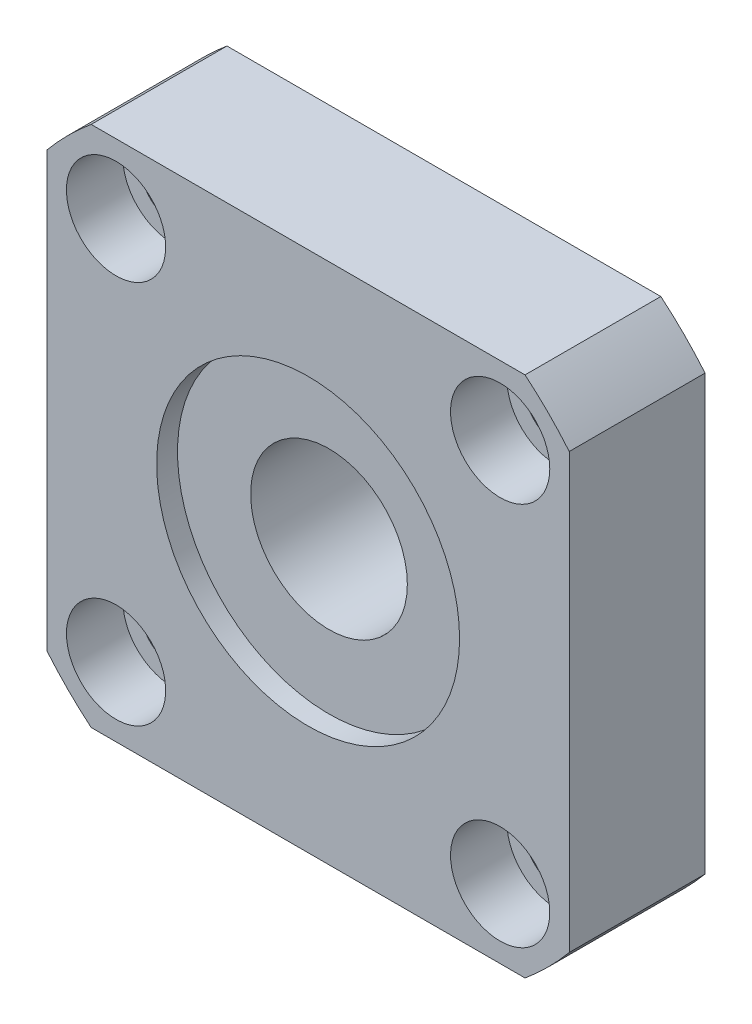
ISO-10303-21;
HEADER;
FILE_DESCRIPTION(('STEP AP214'),'2;1');
FILE_NAME('part.step','',(''),(''),'','','');
FILE_SCHEMA(('AUTOMOTIVE_DESIGN { 1 0 10303 214 1 1 1 1 }'));
ENDSEC;
DATA;
#1=APPLICATION_CONTEXT('core data for automotive mechanical design processes');
#2=APPLICATION_PROTOCOL_DEFINITION('international standard','automotive_design',2000,#1);
#3=PRODUCT_CONTEXT('',#1,'mechanical');
#4=PRODUCT('Part','Part','',(#3));
#5=PRODUCT_RELATED_PRODUCT_CATEGORY('part','',(#4));
#6=PRODUCT_DEFINITION_FORMATION('','',#4);
#7=PRODUCT_DEFINITION_CONTEXT('part definition',#1,'design');
#8=PRODUCT_DEFINITION('design','',#6,#7);
#9=PRODUCT_DEFINITION_SHAPE('','',#8);
#10=(LENGTH_UNIT() NAMED_UNIT(*) SI_UNIT(.MILLI.,.METRE.));
#11=(NAMED_UNIT(*) PLANE_ANGLE_UNIT() SI_UNIT($,.RADIAN.));
#12=(NAMED_UNIT(*) SI_UNIT($,.STERADIAN.) SOLID_ANGLE_UNIT());
#13=UNCERTAINTY_MEASURE_WITH_UNIT(LENGTH_MEASURE(1.E-05),#10,'distance_accuracy_value','');
#14=(GEOMETRIC_REPRESENTATION_CONTEXT(3) GLOBAL_UNCERTAINTY_ASSIGNED_CONTEXT((#13)) GLOBAL_UNIT_ASSIGNED_CONTEXT((#10,
#11,#12)) REPRESENTATION_CONTEXT('',''));
#15=CARTESIAN_POINT('',(0.,0.,0.));
#16=DIRECTION('',(0.,0.,1.));
#17=DIRECTION('',(1.,0.,0.));
#18=AXIS2_PLACEMENT_3D('',#15,#16,#17);
#19=CARTESIAN_POINT('',(0.,0.,13.));
#20=DIRECTION('',(0.,0.,-1.));
#21=DIRECTION('',(-1.,0.,0.));
#22=AXIS2_PLACEMENT_3D('',#19,#20,#21);
#23=CYLINDRICAL_SURFACE('',#22,7.5);
#24=CARTESIAN_POINT('',(0.,0.,0.));
#25=DIRECTION('',(0.,0.,1.));
#26=DIRECTION('',(1.,0.,0.));
#27=AXIS2_PLACEMENT_3D('',#24,#25,#26);
#28=CIRCLE('',#27,7.5);
#29=CARTESIAN_POINT('',(7.5,0.,0.));
#30=VERTEX_POINT('',#29);
#31=EDGE_CURVE('E95',#30,#30,#28,.T.);
#32=ORIENTED_EDGE('',*,*,#31,.F.);
#33=EDGE_LOOP('',(#32));
#34=FACE_BOUND('',#33,.T.);
#35=CARTESIAN_POINT('',(0.,0.,11.));
#36=DIRECTION('',(0.,0.,1.));
#37=DIRECTION('',(1.,0.,0.));
#38=AXIS2_PLACEMENT_3D('',#35,#36,#37);
#39=CIRCLE('',#38,7.5);
#40=CARTESIAN_POINT('',(7.5,0.,11.));
#41=VERTEX_POINT('',#40);
#42=EDGE_CURVE('E18',#41,#41,#39,.T.);
#43=ORIENTED_EDGE('',*,*,#42,.T.);
#44=EDGE_LOOP('',(#43));
#45=FACE_BOUND('',#44,.T.);
#46=ADVANCED_FACE('F14',(#34,#45),#23,.F.);
#47=CARTESIAN_POINT('',(-18.3847763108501,18.3847763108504,0.));
#48=DIRECTION('',(0.,0.,1.));
#49=DIRECTION('',(1.,0.,0.));
#50=AXIS2_PLACEMENT_3D('',#47,#48,#49);
#51=CYLINDRICAL_SURFACE('',#50,3.);
#52=CARTESIAN_POINT('',(-18.3847763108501,18.3847763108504,0.));
#53=DIRECTION('',(0.,0.,1.));
#54=DIRECTION('',(0.,1.,0.));
#55=AXIS2_PLACEMENT_3D('',#52,#53,#54);
#56=CIRCLE('',#55,3.);
#57=CARTESIAN_POINT('',(-18.3847763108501,21.3847763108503,0.));
#58=VERTEX_POINT('',#57);
#59=EDGE_CURVE('E158',#58,#58,#56,.T.);
#60=ORIENTED_EDGE('',*,*,#59,.F.);
#61=EDGE_LOOP('',(#60));
#62=FACE_BOUND('',#61,.T.);
#63=CARTESIAN_POINT('',(-18.3847763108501,18.3847763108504,7.6));
#64=DIRECTION('',(0.,0.,1.));
#65=DIRECTION('',(1.,0.,0.));
#66=AXIS2_PLACEMENT_3D('',#63,#64,#65);
#67=CIRCLE('',#66,3.);
#68=CARTESIAN_POINT('',(-15.3847763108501,18.3847763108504,7.6));
#69=VERTEX_POINT('',#68);
#70=EDGE_CURVE('E164',#69,#69,#67,.F.);
#71=ORIENTED_EDGE('',*,*,#70,.F.);
#72=EDGE_LOOP('',(#71));
#73=FACE_BOUND('',#72,.T.);
#74=ADVANCED_FACE('F206',(#62,#73),#51,.F.);
#75=CARTESIAN_POINT('',(-18.3847763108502,-18.3847763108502,0.));
#76=DIRECTION('',(0.,0.,1.));
#77=DIRECTION('',(1.,0.,0.));
#78=AXIS2_PLACEMENT_3D('',#75,#76,#77);
#79=CYLINDRICAL_SURFACE('',#78,3.);
#80=CARTESIAN_POINT('',(-18.3847763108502,-18.3847763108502,0.));
#81=DIRECTION('',(0.,0.,1.));
#82=DIRECTION('',(-1.,0.,0.));
#83=AXIS2_PLACEMENT_3D('',#80,#81,#82);
#84=CIRCLE('',#83,3.);
#85=CARTESIAN_POINT('',(-21.3847763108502,-18.3847763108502,0.));
#86=VERTEX_POINT('',#85);
#87=EDGE_CURVE('E189',#86,#86,#84,.T.);
#88=ORIENTED_EDGE('',*,*,#87,.F.);
#89=EDGE_LOOP('',(#88));
#90=FACE_BOUND('',#89,.T.);
#91=CARTESIAN_POINT('',(-18.3847763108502,-18.3847763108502,7.6));
#92=DIRECTION('',(0.,0.,1.));
#93=DIRECTION('',(1.,0.,0.));
#94=AXIS2_PLACEMENT_3D('',#91,#92,#93);
#95=CIRCLE('',#94,3.);
#96=CARTESIAN_POINT('',(-15.3847763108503,-18.3847763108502,7.6));
#97=VERTEX_POINT('',#96);
#98=EDGE_CURVE('E160',#97,#97,#95,.F.);
#99=ORIENTED_EDGE('',*,*,#98,.F.);
#100=EDGE_LOOP('',(#99));
#101=FACE_BOUND('',#100,.T.);
#102=ADVANCED_FACE('F288',(#90,#101),#79,.F.);
#103=CARTESIAN_POINT('',(18.3847763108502,-18.3847763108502,0.));
#104=DIRECTION('',(0.,0.,1.));
#105=DIRECTION('',(1.,0.,0.));
#106=AXIS2_PLACEMENT_3D('',#103,#104,#105);
#107=CYLINDRICAL_SURFACE('',#106,3.);
#108=CARTESIAN_POINT('',(18.3847763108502,-18.3847763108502,0.));
#109=DIRECTION('',(0.,0.,1.));
#110=DIRECTION('',(0.,-1.,0.));
#111=AXIS2_PLACEMENT_3D('',#108,#109,#110);
#112=CIRCLE('',#111,3.);
#113=CARTESIAN_POINT('',(18.3847763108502,-21.3847763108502,0.));
#114=VERTEX_POINT('',#113);
#115=EDGE_CURVE('E192',#114,#114,#112,.T.);
#116=ORIENTED_EDGE('',*,*,#115,.F.);
#117=EDGE_LOOP('',(#116));
#118=FACE_BOUND('',#117,.T.);
#119=CARTESIAN_POINT('',(18.3847763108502,-18.3847763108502,7.6));
#120=DIRECTION('',(0.,0.,1.));
#121=DIRECTION('',(1.,0.,0.));
#122=AXIS2_PLACEMENT_3D('',#119,#120,#121);
#123=CIRCLE('',#122,3.);
#124=CARTESIAN_POINT('',(21.3847763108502,-18.3847763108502,7.6));
#125=VERTEX_POINT('',#124);
#126=EDGE_CURVE('E155',#125,#125,#123,.F.);
#127=ORIENTED_EDGE('',*,*,#126,.F.);
#128=EDGE_LOOP('',(#127));
#129=FACE_BOUND('',#128,.T.);
#130=ADVANCED_FACE('F276',(#118,#129),#107,.F.);
#131=CARTESIAN_POINT('',(18.3847763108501,18.3847763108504,0.));
#132=DIRECTION('',(0.,0.,1.));
#133=DIRECTION('',(1.,0.,0.));
#134=AXIS2_PLACEMENT_3D('',#131,#132,#133);
#135=CYLINDRICAL_SURFACE('',#134,3.);
#136=CARTESIAN_POINT('',(18.3847763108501,18.3847763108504,0.));
#137=DIRECTION('',(0.,0.,1.));
#138=DIRECTION('',(1.,0.,0.));
#139=AXIS2_PLACEMENT_3D('',#136,#137,#138);
#140=CIRCLE('',#139,3.);
#141=CARTESIAN_POINT('',(21.3847763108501,18.3847763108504,0.));
#142=VERTEX_POINT('',#141);
#143=EDGE_CURVE('E153',#142,#142,#140,.T.);
#144=ORIENTED_EDGE('',*,*,#143,.F.);
#145=EDGE_LOOP('',(#144));
#146=FACE_BOUND('',#145,.T.);
#147=CARTESIAN_POINT('',(18.3847763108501,18.3847763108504,7.6));
#148=DIRECTION('',(0.,0.,1.));
#149=DIRECTION('',(1.,0.,0.));
#150=AXIS2_PLACEMENT_3D('',#147,#148,#149);
#151=CIRCLE('',#150,3.);
#152=CARTESIAN_POINT('',(21.3847763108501,18.3847763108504,7.6));
#153=VERTEX_POINT('',#152);
#154=EDGE_CURVE('E150',#153,#153,#151,.F.);
#155=ORIENTED_EDGE('',*,*,#154,.F.);
#156=EDGE_LOOP('',(#155));
#157=FACE_BOUND('',#156,.T.);
#158=ADVANCED_FACE('F225',(#146,#157),#135,.F.);
#159=CARTESIAN_POINT('',(0.,0.,13.));
#160=DIRECTION('',(0.,0.,1.));
#161=DIRECTION('',(1.,0.,0.));
#162=AXIS2_PLACEMENT_3D('',#159,#160,#161);
#163=PLANE('',#162);
#164=CARTESIAN_POINT('',(0.,0.,13.));
#165=DIRECTION('',(0.,0.,1.));
#166=DIRECTION('',(1.,0.,0.));
#167=AXIS2_PLACEMENT_3D('',#164,#165,#166);
#168=CIRCLE('',#167,14.5);
#169=CARTESIAN_POINT('',(14.5,0.,13.));
#170=VERTEX_POINT('',#169);
#171=EDGE_CURVE('E213',#170,#170,#168,.T.);
#172=ORIENTED_EDGE('',*,*,#171,.F.);
#173=EDGE_LOOP('',(#172));
#174=FACE_BOUND('',#173,.T.);
#175=CARTESIAN_POINT('',(-18.3847763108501,18.3847763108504,13.));
#176=DIRECTION('',(0.,0.,1.));
#177=DIRECTION('',(0.,1.,0.));
#178=AXIS2_PLACEMENT_3D('',#175,#176,#177);
#179=CIRCLE('',#178,4.75);
#180=CARTESIAN_POINT('',(-18.3847763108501,23.1347763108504,13.));
#181=VERTEX_POINT('',#180);
#182=EDGE_CURVE('E173',#181,#181,#179,.T.);
#183=ORIENTED_EDGE('',*,*,#182,.F.);
#184=EDGE_LOOP('',(#183));
#185=FACE_BOUND('',#184,.T.);
#186=CARTESIAN_POINT('',(-18.3847763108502,-18.3847763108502,13.));
#187=DIRECTION('',(0.,0.,1.));
#188=DIRECTION('',(-1.,0.,0.));
#189=AXIS2_PLACEMENT_3D('',#186,#187,#188);
#190=CIRCLE('',#189,4.75);
#191=CARTESIAN_POINT('',(-23.1347763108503,-18.3847763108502,13.));
#192=VERTEX_POINT('',#191);
#193=EDGE_CURVE('E166',#192,#192,#190,.T.);
#194=ORIENTED_EDGE('',*,*,#193,.F.);
#195=EDGE_LOOP('',(#194));
#196=FACE_BOUND('',#195,.T.);
#197=CARTESIAN_POINT('',(18.3847763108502,-18.3847763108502,13.));
#198=DIRECTION('',(0.,0.,1.));
#199=DIRECTION('',(0.,-1.,0.));
#200=AXIS2_PLACEMENT_3D('',#197,#198,#199);
#201=CIRCLE('',#200,4.75);
#202=CARTESIAN_POINT('',(18.3847763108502,-23.1347763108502,13.));
#203=VERTEX_POINT('',#202);
#204=EDGE_CURVE('E162',#203,#203,#201,.T.);
#205=ORIENTED_EDGE('',*,*,#204,.F.);
#206=EDGE_LOOP('',(#205));
#207=FACE_BOUND('',#206,.T.);
#208=CARTESIAN_POINT('',(18.3847763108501,18.3847763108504,13.));
#209=DIRECTION('',(0.,0.,1.));
#210=DIRECTION('',(1.,0.,0.));
#211=AXIS2_PLACEMENT_3D('',#208,#209,#210);
#212=CIRCLE('',#211,4.75);
#213=CARTESIAN_POINT('',(23.1347763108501,18.3847763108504,13.));
#214=VERTEX_POINT('',#213);
#215=EDGE_CURVE('E195',#214,#214,#212,.T.);
#216=ORIENTED_EDGE('',*,*,#215,.F.);
#217=EDGE_LOOP('',(#216));
#218=FACE_BOUND('',#217,.T.);
#219=CARTESIAN_POINT('',(0.,0.,13.));
#220=DIRECTION('',(0.,0.,1.));
#221=DIRECTION('',(1.,0.,0.));
#222=AXIS2_PLACEMENT_3D('',#219,#220,#221);
#223=CIRCLE('',#222,32.5);
#224=CARTESIAN_POINT('',(25.,20.7665596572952,13.));
#225=VERTEX_POINT('',#224);
#226=CARTESIAN_POINT('',(20.7665596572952,25.,13.));
#227=VERTEX_POINT('',#226);
#228=EDGE_CURVE('E120',#225,#227,#223,.T.);
#229=ORIENTED_EDGE('',*,*,#228,.T.);
#230=DIRECTION('',(-1.,0.,0.));
#231=VECTOR('',#230,1.);
#232=CARTESIAN_POINT('',(20.7665596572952,25.,13.));
#233=LINE('',#232,#231);
#234=CARTESIAN_POINT('',(-20.7665596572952,25.,13.));
#235=VERTEX_POINT('',#234);
#236=EDGE_CURVE('E87',#227,#235,#233,.T.);
#237=ORIENTED_EDGE('',*,*,#236,.T.);
#238=CARTESIAN_POINT('',(0.,0.,13.));
#239=DIRECTION('',(0.,0.,-1.));
#240=DIRECTION('',(-1.,0.,0.));
#241=AXIS2_PLACEMENT_3D('',#238,#239,#240);
#242=CIRCLE('',#241,32.5);
#243=CARTESIAN_POINT('',(-25.,20.7665596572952,13.));
#244=VERTEX_POINT('',#243);
#245=EDGE_CURVE('E123',#244,#235,#242,.T.);
#246=ORIENTED_EDGE('',*,*,#245,.F.);
#247=DIRECTION('',(0.,-1.,0.));
#248=VECTOR('',#247,1.);
#249=CARTESIAN_POINT('',(-25.,20.7665596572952,13.));
#250=LINE('',#249,#248);
#251=CARTESIAN_POINT('',(-25.,-20.7665596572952,13.));
#252=VERTEX_POINT('',#251);
#253=EDGE_CURVE('E126',#244,#252,#250,.T.);
#254=ORIENTED_EDGE('',*,*,#253,.T.);
#255=CARTESIAN_POINT('',(0.,0.,13.));
#256=DIRECTION('',(0.,0.,1.));
#257=DIRECTION('',(1.,0.,0.));
#258=AXIS2_PLACEMENT_3D('',#255,#256,#257);
#259=CIRCLE('',#258,32.5);
#260=CARTESIAN_POINT('',(-20.7665596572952,-25.,13.));
#261=VERTEX_POINT('',#260);
#262=EDGE_CURVE('E129',#252,#261,#259,.T.);
#263=ORIENTED_EDGE('',*,*,#262,.T.);
#264=DIRECTION('',(-1.,0.,0.));
#265=VECTOR('',#264,1.);
#266=CARTESIAN_POINT('',(20.7665596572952,-25.,13.));
#267=LINE('',#266,#265);
#268=CARTESIAN_POINT('',(20.7665596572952,-25.,13.));
#269=VERTEX_POINT('',#268);
#270=EDGE_CURVE('E132',#269,#261,#267,.T.);
#271=ORIENTED_EDGE('',*,*,#270,.F.);
#272=CARTESIAN_POINT('',(0.,0.,13.));
#273=DIRECTION('',(0.,0.,-1.));
#274=DIRECTION('',(-1.,0.,0.));
#275=AXIS2_PLACEMENT_3D('',#272,#273,#274);
#276=CIRCLE('',#275,32.5);
#277=CARTESIAN_POINT('',(25.,-20.7665596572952,13.));
#278=VERTEX_POINT('',#277);
#279=EDGE_CURVE('E135',#278,#269,#276,.T.);
#280=ORIENTED_EDGE('',*,*,#279,.F.);
#281=DIRECTION('',(0.,-1.,0.));
#282=VECTOR('',#281,1.);
#283=CARTESIAN_POINT('',(25.,20.7665596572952,13.));
#284=LINE('',#283,#282);
#285=EDGE_CURVE('E137',#225,#278,#284,.T.);
#286=ORIENTED_EDGE('',*,*,#285,.F.);
#287=EDGE_LOOP('',(#229,#237,#246,#254,#263,#271,#280,#286));
#288=FACE_BOUND('',#287,.T.);
#289=ADVANCED_FACE('F222',(#174,#185,#196,#207,#218,#288),#163,.T.);
#290=CARTESIAN_POINT('',(0.,0.,0.));
#291=DIRECTION('',(0.,0.,1.));
#292=DIRECTION('',(1.,0.,0.));
#293=AXIS2_PLACEMENT_3D('',#290,#291,#292);
#294=PLANE('',#293);
#295=ORIENTED_EDGE('',*,*,#59,.T.);
#296=EDGE_LOOP('',(#295));
#297=FACE_BOUND('',#296,.T.);
#298=ORIENTED_EDGE('',*,*,#87,.T.);
#299=EDGE_LOOP('',(#298));
#300=FACE_BOUND('',#299,.T.);
#301=ORIENTED_EDGE('',*,*,#115,.T.);
#302=EDGE_LOOP('',(#301));
#303=FACE_BOUND('',#302,.T.);
#304=ORIENTED_EDGE('',*,*,#143,.T.);
#305=EDGE_LOOP('',(#304));
#306=FACE_BOUND('',#305,.T.);
#307=CARTESIAN_POINT('',(0.,0.,0.));
#308=DIRECTION('',(0.,0.,1.));
#309=DIRECTION('',(1.,0.,0.));
#310=AXIS2_PLACEMENT_3D('',#307,#308,#309);
#311=CIRCLE('',#310,32.5);
#312=CARTESIAN_POINT('',(25.,20.7665596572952,0.));
#313=VERTEX_POINT('',#312);
#314=CARTESIAN_POINT('',(20.7665596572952,25.,0.));
#315=VERTEX_POINT('',#314);
#316=EDGE_CURVE('E91',#313,#315,#311,.T.);
#317=ORIENTED_EDGE('',*,*,#316,.F.);
#318=DIRECTION('',(0.,-1.,0.));
#319=VECTOR('',#318,1.);
#320=CARTESIAN_POINT('',(25.,20.7665596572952,0.));
#321=LINE('',#320,#319);
#322=CARTESIAN_POINT('',(25.,-20.7665596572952,0.));
#323=VERTEX_POINT('',#322);
#324=EDGE_CURVE('E118',#313,#323,#321,.T.);
#325=ORIENTED_EDGE('',*,*,#324,.T.);
#326=CARTESIAN_POINT('',(0.,0.,0.));
#327=DIRECTION('',(0.,0.,-1.));
#328=DIRECTION('',(-1.,0.,0.));
#329=AXIS2_PLACEMENT_3D('',#326,#327,#328);
#330=CIRCLE('',#329,32.5);
#331=CARTESIAN_POINT('',(20.7665596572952,-25.,0.));
#332=VERTEX_POINT('',#331);
#333=EDGE_CURVE('E115',#323,#332,#330,.T.);
#334=ORIENTED_EDGE('',*,*,#333,.T.);
#335=DIRECTION('',(-1.,0.,0.));
#336=VECTOR('',#335,1.);
#337=CARTESIAN_POINT('',(20.7665596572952,-25.,0.));
#338=LINE('',#337,#336);
#339=CARTESIAN_POINT('',(-20.7665596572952,-25.,0.));
#340=VERTEX_POINT('',#339);
#341=EDGE_CURVE('E112',#332,#340,#338,.T.);
#342=ORIENTED_EDGE('',*,*,#341,.T.);
#343=CARTESIAN_POINT('',(0.,0.,0.));
#344=DIRECTION('',(0.,0.,1.));
#345=DIRECTION('',(1.,0.,0.));
#346=AXIS2_PLACEMENT_3D('',#343,#344,#345);
#347=CIRCLE('',#346,32.5);
#348=CARTESIAN_POINT('',(-25.,-20.7665596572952,0.));
#349=VERTEX_POINT('',#348);
#350=EDGE_CURVE('E109',#349,#340,#347,.T.);
#351=ORIENTED_EDGE('',*,*,#350,.F.);
#352=DIRECTION('',(0.,-1.,0.));
#353=VECTOR('',#352,1.);
#354=CARTESIAN_POINT('',(-25.,20.7665596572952,0.));
#355=LINE('',#354,#353);
#356=CARTESIAN_POINT('',(-25.,20.7665596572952,0.));
#357=VERTEX_POINT('',#356);
#358=EDGE_CURVE('E103',#357,#349,#355,.T.);
#359=ORIENTED_EDGE('',*,*,#358,.F.);
#360=CARTESIAN_POINT('',(0.,0.,0.));
#361=DIRECTION('',(0.,0.,-1.));
#362=DIRECTION('',(-1.,0.,0.));
#363=AXIS2_PLACEMENT_3D('',#360,#361,#362);
#364=CIRCLE('',#363,32.5);
#365=CARTESIAN_POINT('',(-20.7665596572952,25.,0.));
#366=VERTEX_POINT('',#365);
#367=EDGE_CURVE('E101',#357,#366,#364,.T.);
#368=ORIENTED_EDGE('',*,*,#367,.T.);
#369=DIRECTION('',(-1.,0.,0.));
#370=VECTOR('',#369,1.);
#371=CARTESIAN_POINT('',(20.7665596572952,25.,0.));
#372=LINE('',#371,#370);
#373=EDGE_CURVE('E84',#315,#366,#372,.T.);
#374=ORIENTED_EDGE('',*,*,#373,.F.);
#375=EDGE_LOOP('',(#317,#325,#334,#342,#351,#359,#368,#374));
#376=FACE_BOUND('',#375,.T.);
#377=ORIENTED_EDGE('',*,*,#31,.T.);
#378=EDGE_LOOP('',(#377));
#379=FACE_BOUND('',#378,.T.);
#380=ADVANCED_FACE('F97',(#297,#300,#303,#306,#376,#379),#294,.F.);
#381=CARTESIAN_POINT('',(0.,0.,13.));
#382=DIRECTION('',(0.,0.,-1.));
#383=DIRECTION('',(-1.,0.,0.));
#384=AXIS2_PLACEMENT_3D('',#381,#382,#383);
#385=CYLINDRICAL_SURFACE('',#384,32.5);
#386=DIRECTION('',(0.,0.,-1.));
#387=VECTOR('',#386,1.);
#388=CARTESIAN_POINT('',(20.7665596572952,25.,13.));
#389=LINE('',#388,#387);
#390=EDGE_CURVE('E9',#227,#315,#389,.T.);
#391=ORIENTED_EDGE('',*,*,#390,.F.);
#392=ORIENTED_EDGE('',*,*,#228,.F.);
#393=DIRECTION('',(0.,0.,-1.));
#394=VECTOR('',#393,1.);
#395=CARTESIAN_POINT('',(25.,20.7665596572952,13.));
#396=LINE('',#395,#394);
#397=EDGE_CURVE('E31',#225,#313,#396,.T.);
#398=ORIENTED_EDGE('',*,*,#397,.T.);
#399=ORIENTED_EDGE('',*,*,#316,.T.);
#400=EDGE_LOOP('',(#391,#392,#398,#399));
#401=FACE_BOUND('',#400,.T.);
#402=ADVANCED_FACE('F92',(#401),#385,.T.);
#403=CARTESIAN_POINT('',(20.7665596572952,25.,13.));
#404=DIRECTION('',(0.,-1.,0.));
#405=DIRECTION('',(0.,0.,-1.));
#406=AXIS2_PLACEMENT_3D('',#403,#404,#405);
#407=PLANE('',#406);
#408=DIRECTION('',(0.,0.,-1.));
#409=VECTOR('',#408,1.);
#410=CARTESIAN_POINT('',(-20.7665596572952,25.,13.));
#411=LINE('',#410,#409);
#412=EDGE_CURVE('E23',#235,#366,#411,.T.);
#413=ORIENTED_EDGE('',*,*,#412,.F.);
#414=ORIENTED_EDGE('',*,*,#236,.F.);
#415=ORIENTED_EDGE('',*,*,#390,.T.);
#416=ORIENTED_EDGE('',*,*,#373,.T.);
#417=EDGE_LOOP('',(#413,#414,#415,#416));
#418=FACE_BOUND('',#417,.T.);
#419=ADVANCED_FACE('F16',(#418),#407,.F.);
#420=CARTESIAN_POINT('',(0.,0.,13.));
#421=DIRECTION('',(0.,0.,-1.));
#422=DIRECTION('',(-1.,0.,0.));
#423=AXIS2_PLACEMENT_3D('',#420,#421,#422);
#424=CYLINDRICAL_SURFACE('',#423,32.5);
#425=DIRECTION('',(0.,0.,-1.));
#426=VECTOR('',#425,1.);
#427=CARTESIAN_POINT('',(-25.,20.7665596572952,13.));
#428=LINE('',#427,#426);
#429=EDGE_CURVE('E147',#244,#357,#428,.T.);
#430=ORIENTED_EDGE('',*,*,#429,.F.);
#431=ORIENTED_EDGE('',*,*,#245,.T.);
#432=ORIENTED_EDGE('',*,*,#412,.T.);
#433=ORIENTED_EDGE('',*,*,#367,.F.);
#434=EDGE_LOOP('',(#430,#431,#432,#433));
#435=FACE_BOUND('',#434,.T.);
#436=ADVANCED_FACE('F251',(#435),#424,.T.);
#437=CARTESIAN_POINT('',(-25.,20.7665596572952,13.));
#438=DIRECTION('',(1.,0.,0.));
#439=DIRECTION('',(0.,0.,-1.));
#440=AXIS2_PLACEMENT_3D('',#437,#438,#439);
#441=PLANE('',#440);
#442=DIRECTION('',(0.,0.,-1.));
#443=VECTOR('',#442,1.);
#444=CARTESIAN_POINT('',(-25.,-20.7665596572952,13.));
#445=LINE('',#444,#443);
#446=EDGE_CURVE('E145',#252,#349,#445,.T.);
#447=ORIENTED_EDGE('',*,*,#446,.F.);
#448=ORIENTED_EDGE('',*,*,#253,.F.);
#449=ORIENTED_EDGE('',*,*,#429,.T.);
#450=ORIENTED_EDGE('',*,*,#358,.T.);
#451=EDGE_LOOP('',(#447,#448,#449,#450));
#452=FACE_BOUND('',#451,.T.);
#453=ADVANCED_FACE('F249',(#452),#441,.F.);
#454=CARTESIAN_POINT('',(0.,0.,13.));
#455=DIRECTION('',(0.,0.,-1.));
#456=DIRECTION('',(-1.,0.,0.));
#457=AXIS2_PLACEMENT_3D('',#454,#455,#456);
#458=CYLINDRICAL_SURFACE('',#457,32.5);
#459=DIRECTION('',(0.,0.,-1.));
#460=VECTOR('',#459,1.);
#461=CARTESIAN_POINT('',(-20.7665596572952,-25.,13.));
#462=LINE('',#461,#460);
#463=EDGE_CURVE('E143',#261,#340,#462,.T.);
#464=ORIENTED_EDGE('',*,*,#463,.F.);
#465=ORIENTED_EDGE('',*,*,#262,.F.);
#466=ORIENTED_EDGE('',*,*,#446,.T.);
#467=ORIENTED_EDGE('',*,*,#350,.T.);
#468=EDGE_LOOP('',(#464,#465,#466,#467));
#469=FACE_BOUND('',#468,.T.);
#470=ADVANCED_FACE('F246',(#469),#458,.T.);
#471=CARTESIAN_POINT('',(20.7665596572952,-25.,13.));
#472=DIRECTION('',(0.,-1.,0.));
#473=DIRECTION('',(0.,0.,-1.));
#474=AXIS2_PLACEMENT_3D('',#471,#472,#473);
#475=PLANE('',#474);
#476=DIRECTION('',(0.,0.,-1.));
#477=VECTOR('',#476,1.);
#478=CARTESIAN_POINT('',(20.7665596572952,-25.,13.));
#479=LINE('',#478,#477);
#480=EDGE_CURVE('E141',#269,#332,#479,.T.);
#481=ORIENTED_EDGE('',*,*,#480,.F.);
#482=ORIENTED_EDGE('',*,*,#270,.T.);
#483=ORIENTED_EDGE('',*,*,#463,.T.);
#484=ORIENTED_EDGE('',*,*,#341,.F.);
#485=EDGE_LOOP('',(#481,#482,#483,#484));
#486=FACE_BOUND('',#485,.T.);
#487=ADVANCED_FACE('F243',(#486),#475,.T.);
#488=CARTESIAN_POINT('',(0.,0.,13.));
#489=DIRECTION('',(0.,0.,-1.));
#490=DIRECTION('',(-1.,0.,0.));
#491=AXIS2_PLACEMENT_3D('',#488,#489,#490);
#492=CYLINDRICAL_SURFACE('',#491,32.5);
#493=DIRECTION('',(0.,0.,-1.));
#494=VECTOR('',#493,1.);
#495=CARTESIAN_POINT('',(25.,-20.7665596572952,13.));
#496=LINE('',#495,#494);
#497=EDGE_CURVE('E39',#278,#323,#496,.T.);
#498=ORIENTED_EDGE('',*,*,#497,.F.);
#499=ORIENTED_EDGE('',*,*,#279,.T.);
#500=ORIENTED_EDGE('',*,*,#480,.T.);
#501=ORIENTED_EDGE('',*,*,#333,.F.);
#502=EDGE_LOOP('',(#498,#499,#500,#501));
#503=FACE_BOUND('',#502,.T.);
#504=ADVANCED_FACE('F239',(#503),#492,.T.);
#505=CARTESIAN_POINT('',(25.,20.7665596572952,13.));
#506=DIRECTION('',(1.,0.,0.));
#507=DIRECTION('',(0.,0.,-1.));
#508=AXIS2_PLACEMENT_3D('',#505,#506,#507);
#509=PLANE('',#508);
#510=ORIENTED_EDGE('',*,*,#285,.T.);
#511=ORIENTED_EDGE('',*,*,#497,.T.);
#512=ORIENTED_EDGE('',*,*,#324,.F.);
#513=ORIENTED_EDGE('',*,*,#397,.F.);
#514=EDGE_LOOP('',(#510,#511,#512,#513));
#515=FACE_BOUND('',#514,.T.);
#516=ADVANCED_FACE('F238',(#515),#509,.T.);
#517=CARTESIAN_POINT('',(18.3847763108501,18.3847763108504,7.6));
#518=DIRECTION('',(0.,0.,1.));
#519=DIRECTION('',(1.,0.,0.));
#520=AXIS2_PLACEMENT_3D('',#517,#518,#519);
#521=PLANE('',#520);
#522=CARTESIAN_POINT('',(18.3847763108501,18.3847763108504,7.6));
#523=DIRECTION('',(0.,0.,1.));
#524=DIRECTION('',(1.,0.,0.));
#525=AXIS2_PLACEMENT_3D('',#522,#523,#524);
#526=CIRCLE('',#525,4.75);
#527=CARTESIAN_POINT('',(23.1347763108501,18.3847763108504,7.6));
#528=VERTEX_POINT('',#527);
#529=EDGE_CURVE('E154',#528,#528,#526,.T.);
#530=ORIENTED_EDGE('',*,*,#529,.T.);
#531=EDGE_LOOP('',(#530));
#532=FACE_BOUND('',#531,.T.);
#533=ORIENTED_EDGE('',*,*,#154,.T.);
#534=EDGE_LOOP('',(#533));
#535=FACE_BOUND('',#534,.T.);
#536=ADVANCED_FACE('F268',(#532,#535),#521,.T.);
#537=CARTESIAN_POINT('',(18.3847763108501,18.3847763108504,7.6));
#538=DIRECTION('',(0.,0.,1.));
#539=DIRECTION('',(1.,0.,0.));
#540=AXIS2_PLACEMENT_3D('',#537,#538,#539);
#541=CYLINDRICAL_SURFACE('',#540,4.75);
#542=ORIENTED_EDGE('',*,*,#529,.F.);
#543=EDGE_LOOP('',(#542));
#544=FACE_BOUND('',#543,.T.);
#545=ORIENTED_EDGE('',*,*,#215,.T.);
#546=EDGE_LOOP('',(#545));
#547=FACE_BOUND('',#546,.T.);
#548=ADVANCED_FACE('F278',(#544,#547),#541,.F.);
#549=CARTESIAN_POINT('',(18.3847763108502,-18.3847763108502,7.6));
#550=DIRECTION('',(0.,0.,1.));
#551=DIRECTION('',(0.,-1.,0.));
#552=AXIS2_PLACEMENT_3D('',#549,#550,#551);
#553=PLANE('',#552);
#554=CARTESIAN_POINT('',(18.3847763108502,-18.3847763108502,7.6));
#555=DIRECTION('',(0.,0.,1.));
#556=DIRECTION('',(0.,-1.,0.));
#557=AXIS2_PLACEMENT_3D('',#554,#555,#556);
#558=CIRCLE('',#557,4.75);
#559=CARTESIAN_POINT('',(18.3847763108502,-23.1347763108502,7.6));
#560=VERTEX_POINT('',#559);
#561=EDGE_CURVE('E159',#560,#560,#558,.T.);
#562=ORIENTED_EDGE('',*,*,#561,.T.);
#563=EDGE_LOOP('',(#562));
#564=FACE_BOUND('',#563,.T.);
#565=ORIENTED_EDGE('',*,*,#126,.T.);
#566=EDGE_LOOP('',(#565));
#567=FACE_BOUND('',#566,.T.);
#568=ADVANCED_FACE('F281',(#564,#567),#553,.T.);
#569=CARTESIAN_POINT('',(18.3847763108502,-18.3847763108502,7.6));
#570=DIRECTION('',(0.,0.,1.));
#571=DIRECTION('',(1.,0.,0.));
#572=AXIS2_PLACEMENT_3D('',#569,#570,#571);
#573=CYLINDRICAL_SURFACE('',#572,4.75);
#574=ORIENTED_EDGE('',*,*,#561,.F.);
#575=EDGE_LOOP('',(#574));
#576=FACE_BOUND('',#575,.T.);
#577=ORIENTED_EDGE('',*,*,#204,.T.);
#578=EDGE_LOOP('',(#577));
#579=FACE_BOUND('',#578,.T.);
#580=ADVANCED_FACE('F296',(#576,#579),#573,.F.);
#581=CARTESIAN_POINT('',(-18.3847763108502,-18.3847763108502,7.6));
#582=DIRECTION('',(0.,0.,1.));
#583=DIRECTION('',(-1.,0.,0.));
#584=AXIS2_PLACEMENT_3D('',#581,#582,#583);
#585=PLANE('',#584);
#586=CARTESIAN_POINT('',(-18.3847763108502,-18.3847763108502,7.6));
#587=DIRECTION('',(0.,0.,1.));
#588=DIRECTION('',(-1.,0.,0.));
#589=AXIS2_PLACEMENT_3D('',#586,#587,#588);
#590=CIRCLE('',#589,4.75);
#591=CARTESIAN_POINT('',(-23.1347763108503,-18.3847763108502,7.6));
#592=VERTEX_POINT('',#591);
#593=EDGE_CURVE('E163',#592,#592,#590,.T.);
#594=ORIENTED_EDGE('',*,*,#593,.T.);
#595=EDGE_LOOP('',(#594));
#596=FACE_BOUND('',#595,.T.);
#597=ORIENTED_EDGE('',*,*,#98,.T.);
#598=EDGE_LOOP('',(#597));
#599=FACE_BOUND('',#598,.T.);
#600=ADVANCED_FACE('F299',(#596,#599),#585,.T.);
#601=CARTESIAN_POINT('',(-18.3847763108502,-18.3847763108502,7.6));
#602=DIRECTION('',(0.,0.,1.));
#603=DIRECTION('',(1.,0.,0.));
#604=AXIS2_PLACEMENT_3D('',#601,#602,#603);
#605=CYLINDRICAL_SURFACE('',#604,4.75);
#606=ORIENTED_EDGE('',*,*,#593,.F.);
#607=EDGE_LOOP('',(#606));
#608=FACE_BOUND('',#607,.T.);
#609=ORIENTED_EDGE('',*,*,#193,.T.);
#610=EDGE_LOOP('',(#609));
#611=FACE_BOUND('',#610,.T.);
#612=ADVANCED_FACE('F304',(#608,#611),#605,.F.);
#613=CARTESIAN_POINT('',(-18.3847763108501,18.3847763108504,7.6));
#614=DIRECTION('',(0.,0.,1.));
#615=DIRECTION('',(0.,1.,0.));
#616=AXIS2_PLACEMENT_3D('',#613,#614,#615);
#617=PLANE('',#616);
#618=CARTESIAN_POINT('',(-18.3847763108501,18.3847763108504,7.6));
#619=DIRECTION('',(0.,0.,1.));
#620=DIRECTION('',(0.,1.,0.));
#621=AXIS2_PLACEMENT_3D('',#618,#619,#620);
#622=CIRCLE('',#621,4.75);
#623=CARTESIAN_POINT('',(-18.3847763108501,23.1347763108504,7.6));
#624=VERTEX_POINT('',#623);
#625=EDGE_CURVE('E167',#624,#624,#622,.T.);
#626=ORIENTED_EDGE('',*,*,#625,.T.);
#627=EDGE_LOOP('',(#626));
#628=FACE_BOUND('',#627,.T.);
#629=ORIENTED_EDGE('',*,*,#70,.T.);
#630=EDGE_LOOP('',(#629));
#631=FACE_BOUND('',#630,.T.);
#632=ADVANCED_FACE('F307',(#628,#631),#617,.T.);
#633=CARTESIAN_POINT('',(-18.3847763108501,18.3847763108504,7.6));
#634=DIRECTION('',(0.,0.,1.));
#635=DIRECTION('',(1.,0.,0.));
#636=AXIS2_PLACEMENT_3D('',#633,#634,#635);
#637=CYLINDRICAL_SURFACE('',#636,4.75);
#638=ORIENTED_EDGE('',*,*,#625,.F.);
#639=EDGE_LOOP('',(#638));
#640=FACE_BOUND('',#639,.T.);
#641=ORIENTED_EDGE('',*,*,#182,.T.);
#642=EDGE_LOOP('',(#641));
#643=FACE_BOUND('',#642,.T.);
#644=ADVANCED_FACE('F312',(#640,#643),#637,.F.);
#645=CARTESIAN_POINT('',(0.,0.,11.));
#646=DIRECTION('',(0.,0.,1.));
#647=DIRECTION('',(1.,0.,0.));
#648=AXIS2_PLACEMENT_3D('',#645,#646,#647);
#649=CYLINDRICAL_SURFACE('',#648,14.5);
#650=CARTESIAN_POINT('',(0.,0.,11.));
#651=DIRECTION('',(0.,0.,1.));
#652=DIRECTION('',(1.,0.,0.));
#653=AXIS2_PLACEMENT_3D('',#650,#651,#652);
#654=CIRCLE('',#653,14.5);
#655=CARTESIAN_POINT('',(14.5,0.,11.));
#656=VERTEX_POINT('',#655);
#657=EDGE_CURVE('E211',#656,#656,#654,.T.);
#658=ORIENTED_EDGE('',*,*,#657,.F.);
#659=EDGE_LOOP('',(#658));
#660=FACE_BOUND('',#659,.T.);
#661=ORIENTED_EDGE('',*,*,#171,.T.);
#662=EDGE_LOOP('',(#661));
#663=FACE_BOUND('',#662,.T.);
#664=ADVANCED_FACE('F220',(#660,#663),#649,.F.);
#665=CARTESIAN_POINT('',(0.,0.,11.));
#666=DIRECTION('',(0.,0.,1.));
#667=DIRECTION('',(1.,0.,0.));
#668=AXIS2_PLACEMENT_3D('',#665,#666,#667);
#669=PLANE('',#668);
#670=ORIENTED_EDGE('',*,*,#42,.F.);
#671=EDGE_LOOP('',(#670));
#672=FACE_BOUND('',#671,.T.);
#673=ORIENTED_EDGE('',*,*,#657,.T.);
#674=EDGE_LOOP('',(#673));
#675=FACE_BOUND('',#674,.T.);
#676=ADVANCED_FACE('F316',(#672,#675),#669,.T.);
#677=CLOSED_SHELL('',(#46,#74,#102,#130,#158,#289,#380,#402,#419,#436,#453,#470,#487,#504,#516,
#536,#548,#568,#580,#600,#612,#632,#644,#664,#676));
#678=MANIFOLD_SOLID_BREP('B1',#677);
#679=ADVANCED_BREP_SHAPE_REPRESENTATION('',(#18,#678),#14);
#680=SHAPE_DEFINITION_REPRESENTATION(#9,#679);
ENDSEC;
END-ISO-10303-21;
